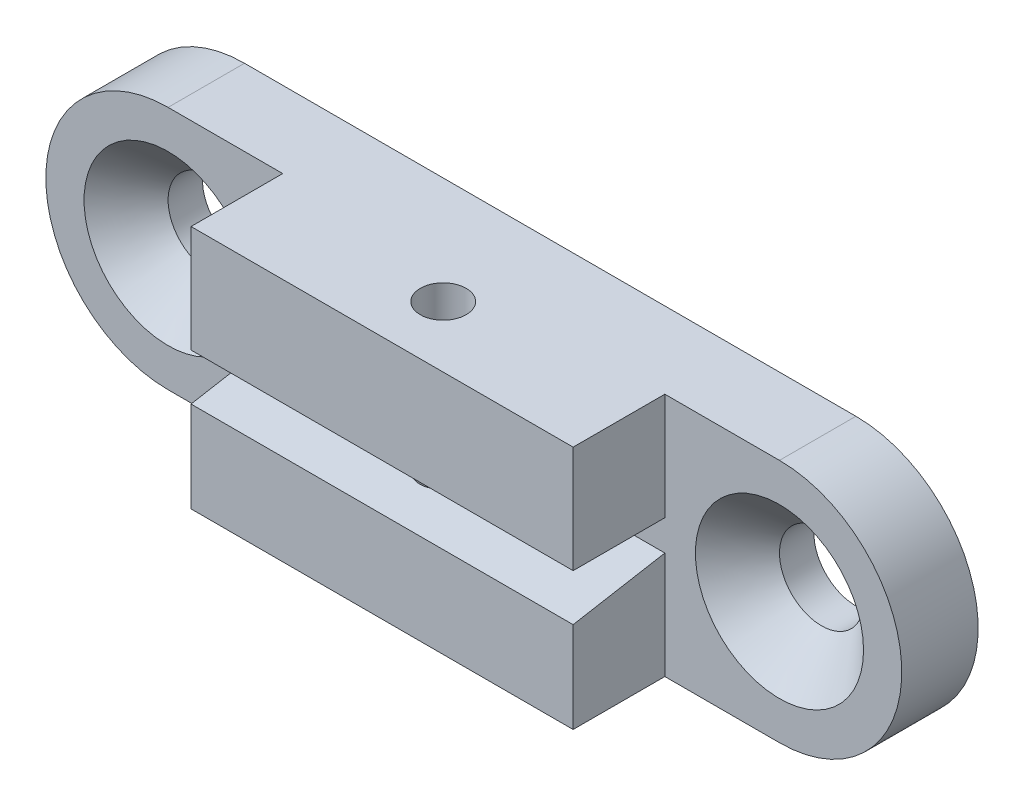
ISO-10303-21;
HEADER;
FILE_DESCRIPTION(('STEP AP214'),'2;1');
FILE_NAME('part.step','',(''),(''),'','','');
FILE_SCHEMA(('AUTOMOTIVE_DESIGN { 1 0 10303 214 1 1 1 1 }'));
ENDSEC;
DATA;
#1=APPLICATION_CONTEXT('core data for automotive mechanical design processes');
#2=APPLICATION_PROTOCOL_DEFINITION('international standard','automotive_design',2000,#1);
#3=PRODUCT_CONTEXT('',#1,'mechanical');
#4=PRODUCT('Part','Part','',(#3));
#5=PRODUCT_RELATED_PRODUCT_CATEGORY('part','',(#4));
#6=PRODUCT_DEFINITION_FORMATION('','',#4);
#7=PRODUCT_DEFINITION_CONTEXT('part definition',#1,'design');
#8=PRODUCT_DEFINITION('design','',#6,#7);
#9=PRODUCT_DEFINITION_SHAPE('','',#8);
#10=(LENGTH_UNIT() NAMED_UNIT(*) SI_UNIT(.MILLI.,.METRE.));
#11=(NAMED_UNIT(*) PLANE_ANGLE_UNIT() SI_UNIT($,.RADIAN.));
#12=(NAMED_UNIT(*) SI_UNIT($,.STERADIAN.) SOLID_ANGLE_UNIT());
#13=UNCERTAINTY_MEASURE_WITH_UNIT(LENGTH_MEASURE(1.E-05),#10,'distance_accuracy_value','');
#14=(GEOMETRIC_REPRESENTATION_CONTEXT(3) GLOBAL_UNCERTAINTY_ASSIGNED_CONTEXT((#13)) GLOBAL_UNIT_ASSIGNED_CONTEXT((#10,
#11,#12)) REPRESENTATION_CONTEXT('',''));
#15=CARTESIAN_POINT('',(0.,0.,0.));
#16=DIRECTION('',(0.,0.,1.));
#17=DIRECTION('',(1.,0.,0.));
#18=AXIS2_PLACEMENT_3D('',#15,#16,#17);
#19=CARTESIAN_POINT('',(12.5,-2.05796188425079,11.));
#20=DIRECTION('',(0.,-0.984807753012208,-0.17364817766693));
#21=DIRECTION('',(0.,0.17364817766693,-0.984807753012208));
#22=AXIS2_PLACEMENT_3D('',#19,#20,#21);
#23=PLANE('',#22);
#24=CARTESIAN_POINT('',(0.,-1.35265396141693,7.));
#25=DIRECTION('',(0.,-0.984807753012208,-0.17364817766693));
#26=DIRECTION('',(0.,0.17364817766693,-0.984807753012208));
#27=AXIS2_PLACEMENT_3D('',#24,#25,#26);
#28=ELLIPSE('',#27,1.52313991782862,1.5);
#29=CARTESIAN_POINT('',(0.,-1.08816349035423,5.5));
#30=VERTEX_POINT('',#29);
#31=EDGE_CURVE('E18',#30,#30,#28,.T.);
#32=ORIENTED_EDGE('',*,*,#31,.T.);
#33=EDGE_LOOP('',(#32));
#34=FACE_BOUND('',#33,.T.);
#35=DIRECTION('',(1.,0.,0.));
#36=VECTOR('',#35,1.);
#37=CARTESIAN_POINT('',(0.,-2.05796188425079,11.));
#38=LINE('',#37,#36);
#39=CARTESIAN_POINT('',(12.5,-2.05796188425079,11.));
#40=VERTEX_POINT('',#39);
#41=CARTESIAN_POINT('',(-12.5,-2.05796188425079,11.));
#42=VERTEX_POINT('',#41);
#43=EDGE_CURVE('E118',#40,#42,#38,.F.);
#44=ORIENTED_EDGE('',*,*,#43,.F.);
#45=DIRECTION('',(0.,-0.17364817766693,0.984807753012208));
#46=VECTOR('',#45,1.);
#47=CARTESIAN_POINT('',(12.5,-1.,5.));
#48=LINE('',#47,#46);
#49=CARTESIAN_POINT('',(12.5,-1.,5.));
#50=VERTEX_POINT('',#49);
#51=EDGE_CURVE('E108',#50,#40,#48,.T.);
#52=ORIENTED_EDGE('',*,*,#51,.F.);
#53=DIRECTION('',(1.,0.,0.));
#54=VECTOR('',#53,1.);
#55=CARTESIAN_POINT('',(0.,-1.,5.));
#56=LINE('',#55,#54);
#57=CARTESIAN_POINT('',(-12.5,-1.,5.));
#58=VERTEX_POINT('',#57);
#59=EDGE_CURVE('E194',#58,#50,#56,.T.);
#60=ORIENTED_EDGE('',*,*,#59,.F.);
#61=DIRECTION('',(0.,0.17364817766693,-0.984807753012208));
#62=VECTOR('',#61,1.);
#63=CARTESIAN_POINT('',(-12.5,-2.05796188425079,11.));
#64=LINE('',#63,#62);
#65=EDGE_CURVE('E125',#42,#58,#64,.T.);
#66=ORIENTED_EDGE('',*,*,#65,.F.);
#67=EDGE_LOOP('',(#44,#52,#60,#66));
#68=FACE_BOUND('',#67,.T.);
#69=ADVANCED_FACE('F15',(#34,#68),#23,.F.);
#70=CARTESIAN_POINT('',(12.5,1.,5.));
#71=DIRECTION('',(0.,1.,0.));
#72=DIRECTION('',(0.,0.,1.));
#73=AXIS2_PLACEMENT_3D('',#70,#71,#72);
#74=PLANE('',#73);
#75=CARTESIAN_POINT('',(0.,1.,7.));
#76=DIRECTION('',(0.,1.,0.));
#77=DIRECTION('',(0.,0.,1.));
#78=AXIS2_PLACEMENT_3D('',#75,#76,#77);
#79=CIRCLE('',#78,1.5);
#80=CARTESIAN_POINT('',(0.,1.,8.5));
#81=VERTEX_POINT('',#80);
#82=EDGE_CURVE('E163',#81,#81,#79,.T.);
#83=ORIENTED_EDGE('',*,*,#82,.T.);
#84=EDGE_LOOP('',(#83));
#85=FACE_BOUND('',#84,.T.);
#86=DIRECTION('',(1.,0.,0.));
#87=VECTOR('',#86,1.);
#88=CARTESIAN_POINT('',(0.,1.,5.));
#89=LINE('',#88,#87);
#90=CARTESIAN_POINT('',(12.5,0.999999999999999,5.));
#91=VERTEX_POINT('',#90);
#92=CARTESIAN_POINT('',(-12.5,1.,5.));
#93=VERTEX_POINT('',#92);
#94=EDGE_CURVE('E162',#91,#93,#89,.F.);
#95=ORIENTED_EDGE('',*,*,#94,.F.);
#96=DIRECTION('',(0.,0.,-1.));
#97=VECTOR('',#96,1.);
#98=CARTESIAN_POINT('',(12.5,0.999999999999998,5.));
#99=LINE('',#98,#97);
#100=CARTESIAN_POINT('',(12.5,0.999999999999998,11.));
#101=VERTEX_POINT('',#100);
#102=EDGE_CURVE('E172',#101,#91,#99,.T.);
#103=ORIENTED_EDGE('',*,*,#102,.F.);
#104=DIRECTION('',(1.,0.,0.));
#105=VECTOR('',#104,1.);
#106=CARTESIAN_POINT('',(0.,0.999999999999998,11.));
#107=LINE('',#106,#105);
#108=CARTESIAN_POINT('',(-12.5,0.999999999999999,11.));
#109=VERTEX_POINT('',#108);
#110=EDGE_CURVE('E130',#109,#101,#107,.T.);
#111=ORIENTED_EDGE('',*,*,#110,.F.);
#112=DIRECTION('',(0.,0.,1.));
#113=VECTOR('',#112,1.);
#114=CARTESIAN_POINT('',(-12.5,1.,5.));
#115=LINE('',#114,#113);
#116=EDGE_CURVE('E207',#93,#109,#115,.T.);
#117=ORIENTED_EDGE('',*,*,#116,.F.);
#118=EDGE_LOOP('',(#95,#103,#111,#117));
#119=FACE_BOUND('',#118,.T.);
#120=ADVANCED_FACE('F261',(#85,#119),#74,.F.);
#121=CARTESIAN_POINT('',(12.5,8.,5.));
#122=DIRECTION('',(1.,0.,0.));
#123=DIRECTION('',(0.,0.,-1.));
#124=AXIS2_PLACEMENT_3D('',#121,#122,#123);
#125=PLANE('',#124);
#126=DIRECTION('',(0.,0.,-1.));
#127=VECTOR('',#126,1.);
#128=CARTESIAN_POINT('',(12.5,-8.,0.));
#129=LINE('',#128,#127);
#130=CARTESIAN_POINT('',(12.5,-8.,5.));
#131=VERTEX_POINT('',#130);
#132=CARTESIAN_POINT('',(12.5,-8.,11.));
#133=VERTEX_POINT('',#132);
#134=EDGE_CURVE('E191',#131,#133,#129,.F.);
#135=ORIENTED_EDGE('',*,*,#134,.F.);
#136=DIRECTION('',(0.,1.,0.));
#137=VECTOR('',#136,1.);
#138=CARTESIAN_POINT('',(12.5,0.,5.));
#139=LINE('',#138,#137);
#140=EDGE_CURVE('E114',#50,#131,#139,.F.);
#141=ORIENTED_EDGE('',*,*,#140,.F.);
#142=ORIENTED_EDGE('',*,*,#51,.T.);
#143=DIRECTION('',(0.,1.,0.));
#144=VECTOR('',#143,1.);
#145=CARTESIAN_POINT('',(12.5,0.,11.));
#146=LINE('',#145,#144);
#147=EDGE_CURVE('E112',#133,#40,#146,.T.);
#148=ORIENTED_EDGE('',*,*,#147,.F.);
#149=EDGE_LOOP('',(#135,#141,#142,#148));
#150=FACE_BOUND('',#149,.T.);
#151=ADVANCED_FACE('F111',(#150),#125,.T.);
#152=CARTESIAN_POINT('',(0.,0.,11.));
#153=DIRECTION('',(0.,0.,1.));
#154=DIRECTION('',(1.,0.,0.));
#155=AXIS2_PLACEMENT_3D('',#152,#153,#154);
#156=PLANE('',#155);
#157=DIRECTION('',(1.,0.,0.));
#158=VECTOR('',#157,1.);
#159=CARTESIAN_POINT('',(20.,-8.,11.));
#160=LINE('',#159,#158);
#161=CARTESIAN_POINT('',(-12.5,-8.,11.));
#162=VERTEX_POINT('',#161);
#163=EDGE_CURVE('E124',#133,#162,#160,.F.);
#164=ORIENTED_EDGE('',*,*,#163,.F.);
#165=ORIENTED_EDGE('',*,*,#147,.T.);
#166=ORIENTED_EDGE('',*,*,#43,.T.);
#167=DIRECTION('',(0.,1.,0.));
#168=VECTOR('',#167,1.);
#169=CARTESIAN_POINT('',(-12.5,-8.,11.));
#170=LINE('',#169,#168);
#171=EDGE_CURVE('E197',#162,#42,#170,.T.);
#172=ORIENTED_EDGE('',*,*,#171,.F.);
#173=EDGE_LOOP('',(#164,#165,#166,#172));
#174=FACE_BOUND('',#173,.T.);
#175=ADVANCED_FACE('F121',(#174),#156,.T.);
#176=CARTESIAN_POINT('',(-12.5,-8.,5.));
#177=DIRECTION('',(-1.,0.,0.));
#178=DIRECTION('',(0.,0.,1.));
#179=AXIS2_PLACEMENT_3D('',#176,#177,#178);
#180=PLANE('',#179);
#181=DIRECTION('',(0.,0.,-1.));
#182=VECTOR('',#181,1.);
#183=CARTESIAN_POINT('',(-12.5,-8.,0.));
#184=LINE('',#183,#182);
#185=CARTESIAN_POINT('',(-12.5,-8.,5.));
#186=VERTEX_POINT('',#185);
#187=EDGE_CURVE('E195',#162,#186,#184,.T.);
#188=ORIENTED_EDGE('',*,*,#187,.F.);
#189=ORIENTED_EDGE('',*,*,#171,.T.);
#190=ORIENTED_EDGE('',*,*,#65,.T.);
#191=DIRECTION('',(0.,1.,0.));
#192=VECTOR('',#191,1.);
#193=CARTESIAN_POINT('',(-12.5,0.,5.));
#194=LINE('',#193,#192);
#195=EDGE_CURVE('E169',#186,#58,#194,.T.);
#196=ORIENTED_EDGE('',*,*,#195,.F.);
#197=EDGE_LOOP('',(#188,#189,#190,#196));
#198=FACE_BOUND('',#197,.T.);
#199=ADVANCED_FACE('F219',(#198),#180,.T.);
#200=CARTESIAN_POINT('',(0.,-8.,7.));
#201=DIRECTION('',(0.,1.,0.));
#202=DIRECTION('',(0.,0.,1.));
#203=AXIS2_PLACEMENT_3D('',#200,#201,#202);
#204=CYLINDRICAL_SURFACE('',#203,1.5);
#205=ORIENTED_EDGE('',*,*,#31,.F.);
#206=EDGE_LOOP('',(#205));
#207=FACE_BOUND('',#206,.T.);
#208=CARTESIAN_POINT('',(0.,-8.,7.));
#209=DIRECTION('',(0.,1.,0.));
#210=DIRECTION('',(0.,0.,1.));
#211=AXIS2_PLACEMENT_3D('',#208,#209,#210);
#212=CIRCLE('',#211,1.5);
#213=CARTESIAN_POINT('',(0.,-8.,8.5));
#214=VERTEX_POINT('',#213);
#215=EDGE_CURVE('E152',#214,#214,#212,.T.);
#216=ORIENTED_EDGE('',*,*,#215,.F.);
#217=EDGE_LOOP('',(#216));
#218=FACE_BOUND('',#217,.T.);
#219=ADVANCED_FACE('F215',(#207,#218),#204,.F.);
#220=CARTESIAN_POINT('',(-12.5,-8.,5.));
#221=DIRECTION('',(-1.,0.,0.));
#222=DIRECTION('',(0.,0.,1.));
#223=AXIS2_PLACEMENT_3D('',#220,#221,#222);
#224=PLANE('',#223);
#225=DIRECTION('',(0.,0.,1.));
#226=VECTOR('',#225,1.);
#227=CARTESIAN_POINT('',(-12.5,8.,0.));
#228=LINE('',#227,#226);
#229=CARTESIAN_POINT('',(-12.5,8.,5.));
#230=VERTEX_POINT('',#229);
#231=CARTESIAN_POINT('',(-12.5,8.,11.));
#232=VERTEX_POINT('',#231);
#233=EDGE_CURVE('E184',#230,#232,#228,.T.);
#234=ORIENTED_EDGE('',*,*,#233,.F.);
#235=DIRECTION('',(0.,1.,0.));
#236=VECTOR('',#235,1.);
#237=CARTESIAN_POINT('',(-12.5,0.,5.));
#238=LINE('',#237,#236);
#239=EDGE_CURVE('E165',#93,#230,#238,.T.);
#240=ORIENTED_EDGE('',*,*,#239,.F.);
#241=ORIENTED_EDGE('',*,*,#116,.T.);
#242=DIRECTION('',(0.,1.,0.));
#243=VECTOR('',#242,1.);
#244=CARTESIAN_POINT('',(-12.5,0.,11.));
#245=LINE('',#244,#243);
#246=EDGE_CURVE('E177',#232,#109,#245,.F.);
#247=ORIENTED_EDGE('',*,*,#246,.F.);
#248=EDGE_LOOP('',(#234,#240,#241,#247));
#249=FACE_BOUND('',#248,.T.);
#250=ADVANCED_FACE('F218',(#249),#224,.T.);
#251=CARTESIAN_POINT('',(0.,0.,11.));
#252=DIRECTION('',(0.,0.,1.));
#253=DIRECTION('',(1.,0.,0.));
#254=AXIS2_PLACEMENT_3D('',#251,#252,#253);
#255=PLANE('',#254);
#256=DIRECTION('',(1.,0.,0.));
#257=VECTOR('',#256,1.);
#258=CARTESIAN_POINT('',(-20.,8.,11.));
#259=LINE('',#258,#257);
#260=CARTESIAN_POINT('',(12.5,8.,11.));
#261=VERTEX_POINT('',#260);
#262=EDGE_CURVE('E182',#232,#261,#259,.T.);
#263=ORIENTED_EDGE('',*,*,#262,.F.);
#264=ORIENTED_EDGE('',*,*,#246,.T.);
#265=ORIENTED_EDGE('',*,*,#110,.T.);
#266=DIRECTION('',(0.,1.,0.));
#267=VECTOR('',#266,1.);
#268=CARTESIAN_POINT('',(12.5,8.,11.));
#269=LINE('',#268,#267);
#270=EDGE_CURVE('E166',#261,#101,#269,.F.);
#271=ORIENTED_EDGE('',*,*,#270,.F.);
#272=EDGE_LOOP('',(#263,#264,#265,#271));
#273=FACE_BOUND('',#272,.T.);
#274=ADVANCED_FACE('F265',(#273),#255,.T.);
#275=CARTESIAN_POINT('',(12.5,8.,5.));
#276=DIRECTION('',(1.,0.,0.));
#277=DIRECTION('',(0.,0.,-1.));
#278=AXIS2_PLACEMENT_3D('',#275,#276,#277);
#279=PLANE('',#278);
#280=DIRECTION('',(0.,0.,1.));
#281=VECTOR('',#280,1.);
#282=CARTESIAN_POINT('',(12.5,8.,0.));
#283=LINE('',#282,#281);
#284=CARTESIAN_POINT('',(12.5,8.,5.));
#285=VERTEX_POINT('',#284);
#286=EDGE_CURVE('E63',#261,#285,#283,.F.);
#287=ORIENTED_EDGE('',*,*,#286,.F.);
#288=ORIENTED_EDGE('',*,*,#270,.T.);
#289=ORIENTED_EDGE('',*,*,#102,.T.);
#290=DIRECTION('',(0.,1.,0.));
#291=VECTOR('',#290,1.);
#292=CARTESIAN_POINT('',(12.5,0.,5.));
#293=LINE('',#292,#291);
#294=EDGE_CURVE('E201',#285,#91,#293,.F.);
#295=ORIENTED_EDGE('',*,*,#294,.F.);
#296=EDGE_LOOP('',(#287,#288,#289,#295));
#297=FACE_BOUND('',#296,.T.);
#298=ADVANCED_FACE('F324',(#297),#279,.T.);
#299=CARTESIAN_POINT('',(0.,-8.,7.));
#300=DIRECTION('',(0.,1.,0.));
#301=DIRECTION('',(0.,0.,1.));
#302=AXIS2_PLACEMENT_3D('',#299,#300,#301);
#303=CYLINDRICAL_SURFACE('',#302,1.5);
#304=CARTESIAN_POINT('',(0.,8.,7.));
#305=DIRECTION('',(0.,1.,0.));
#306=DIRECTION('',(0.,0.,1.));
#307=AXIS2_PLACEMENT_3D('',#304,#305,#306);
#308=CIRCLE('',#307,1.5);
#309=CARTESIAN_POINT('',(0.,8.,8.5));
#310=VERTEX_POINT('',#309);
#311=EDGE_CURVE('E144',#310,#310,#308,.F.);
#312=ORIENTED_EDGE('',*,*,#311,.F.);
#313=EDGE_LOOP('',(#312));
#314=FACE_BOUND('',#313,.T.);
#315=ORIENTED_EDGE('',*,*,#82,.F.);
#316=EDGE_LOOP('',(#315));
#317=FACE_BOUND('',#316,.T.);
#318=ADVANCED_FACE('F320',(#314,#317),#303,.F.);
#319=CARTESIAN_POINT('',(0.,0.,5.));
#320=DIRECTION('',(0.,0.,1.));
#321=DIRECTION('',(1.,0.,0.));
#322=AXIS2_PLACEMENT_3D('',#319,#320,#321);
#323=PLANE('',#322);
#324=CARTESIAN_POINT('',(-20.,0.,5.00000000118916));
#325=DIRECTION('',(0.,0.,1.));
#326=DIRECTION('',(1.,0.,0.));
#327=AXIS2_PLACEMENT_3D('',#324,#325,#326);
#328=CIRCLE('',#327,5.49999999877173);
#329=CARTESIAN_POINT('',(-14.5000000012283,0.,5.00000000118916));
#330=VERTEX_POINT('',#329);
#331=EDGE_CURVE('E156',#330,#330,#328,.F.);
#332=ORIENTED_EDGE('',*,*,#331,.T.);
#333=EDGE_LOOP('',(#332));
#334=FACE_BOUND('',#333,.T.);
#335=CARTESIAN_POINT('',(20.,0.,5.00000000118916));
#336=DIRECTION('',(0.,0.,1.));
#337=DIRECTION('',(1.,0.,0.));
#338=AXIS2_PLACEMENT_3D('',#335,#336,#337);
#339=CIRCLE('',#338,5.49999999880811);
#340=CARTESIAN_POINT('',(25.4999999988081,0.,5.00000000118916));
#341=VERTEX_POINT('',#340);
#342=EDGE_CURVE('E160',#341,#341,#339,.F.);
#343=ORIENTED_EDGE('',*,*,#342,.T.);
#344=EDGE_LOOP('',(#343));
#345=FACE_BOUND('',#344,.T.);
#346=ORIENTED_EDGE('',*,*,#294,.T.);
#347=ORIENTED_EDGE('',*,*,#94,.T.);
#348=ORIENTED_EDGE('',*,*,#239,.T.);
#349=DIRECTION('',(1.,0.,0.));
#350=VECTOR('',#349,1.);
#351=CARTESIAN_POINT('',(-20.,8.,5.));
#352=LINE('',#351,#350);
#353=CARTESIAN_POINT('',(-20.,8.,5.));
#354=VERTEX_POINT('',#353);
#355=EDGE_CURVE('E187',#354,#230,#352,.T.);
#356=ORIENTED_EDGE('',*,*,#355,.F.);
#357=CARTESIAN_POINT('',(-20.,0.,5.));
#358=DIRECTION('',(0.,0.,1.));
#359=DIRECTION('',(1.,0.,0.));
#360=AXIS2_PLACEMENT_3D('',#357,#358,#359);
#361=CIRCLE('',#360,8.);
#362=CARTESIAN_POINT('',(-20.,-8.,5.));
#363=VERTEX_POINT('',#362);
#364=EDGE_CURVE('E142',#363,#354,#361,.F.);
#365=ORIENTED_EDGE('',*,*,#364,.F.);
#366=DIRECTION('',(1.,0.,0.));
#367=VECTOR('',#366,1.);
#368=CARTESIAN_POINT('',(20.,-8.,5.));
#369=LINE('',#368,#367);
#370=EDGE_CURVE('E155',#186,#363,#369,.F.);
#371=ORIENTED_EDGE('',*,*,#370,.F.);
#372=ORIENTED_EDGE('',*,*,#195,.T.);
#373=ORIENTED_EDGE('',*,*,#59,.T.);
#374=ORIENTED_EDGE('',*,*,#140,.T.);
#375=DIRECTION('',(1.,0.,0.));
#376=VECTOR('',#375,1.);
#377=CARTESIAN_POINT('',(20.,-8.,5.));
#378=LINE('',#377,#376);
#379=CARTESIAN_POINT('',(20.,-8.,5.));
#380=VERTEX_POINT('',#379);
#381=EDGE_CURVE('E159',#380,#131,#378,.F.);
#382=ORIENTED_EDGE('',*,*,#381,.F.);
#383=CARTESIAN_POINT('',(20.,0.,5.));
#384=DIRECTION('',(0.,0.,1.));
#385=DIRECTION('',(1.,0.,0.));
#386=AXIS2_PLACEMENT_3D('',#383,#384,#385);
#387=CIRCLE('',#386,8.);
#388=CARTESIAN_POINT('',(20.,8.,5.));
#389=VERTEX_POINT('',#388);
#390=EDGE_CURVE('E148',#389,#380,#387,.F.);
#391=ORIENTED_EDGE('',*,*,#390,.F.);
#392=DIRECTION('',(1.,0.,0.));
#393=VECTOR('',#392,1.);
#394=CARTESIAN_POINT('',(-20.,8.,5.));
#395=LINE('',#394,#393);
#396=EDGE_CURVE('E57',#285,#389,#395,.T.);
#397=ORIENTED_EDGE('',*,*,#396,.F.);
#398=EDGE_LOOP('',(#346,#347,#348,#356,#365,#371,#372,#373,#374,#382,#391,#397));
#399=FACE_BOUND('',#398,.T.);
#400=ADVANCED_FACE('F259',(#334,#345,#399),#323,.T.);
#401=CARTESIAN_POINT('',(20.,0.,5.00000000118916));
#402=DIRECTION('',(0.,0.,1.));
#403=DIRECTION('',(1.,0.,0.));
#404=AXIS2_PLACEMENT_3D('',#401,#402,#403);
#405=CONICAL_SURFACE('',#404,5.49999999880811,0.785398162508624);
#406=ORIENTED_EDGE('',*,*,#342,.F.);
#407=EDGE_LOOP('',(#406));
#408=FACE_BOUND('',#407,.T.);
#409=CARTESIAN_POINT('',(20.,0.,2.25));
#410=DIRECTION('',(0.,0.,1.));
#411=DIRECTION('',(1.,0.,0.));
#412=AXIS2_PLACEMENT_3D('',#409,#410,#411);
#413=CIRCLE('',#412,2.75);
#414=CARTESIAN_POINT('',(22.75,0.,2.25));
#415=VERTEX_POINT('',#414);
#416=EDGE_CURVE('E239',#415,#415,#413,.F.);
#417=ORIENTED_EDGE('',*,*,#416,.T.);
#418=EDGE_LOOP('',(#417));
#419=FACE_BOUND('',#418,.T.);
#420=ADVANCED_FACE('F313',(#408,#419),#405,.F.);
#421=CARTESIAN_POINT('',(-20.,0.,5.00000000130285));
#422=DIRECTION('',(0.,0.,1.));
#423=DIRECTION('',(1.,0.,0.));
#424=AXIS2_PLACEMENT_3D('',#421,#422,#423);
#425=CONICAL_SURFACE('',#424,5.49999999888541,0.785398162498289);
#426=ORIENTED_EDGE('',*,*,#331,.F.);
#427=EDGE_LOOP('',(#426));
#428=FACE_BOUND('',#427,.T.);
#429=CARTESIAN_POINT('',(-20.,0.,2.25));
#430=DIRECTION('',(0.,0.,1.));
#431=DIRECTION('',(1.,0.,0.));
#432=AXIS2_PLACEMENT_3D('',#429,#430,#431);
#433=CIRCLE('',#432,2.75);
#434=CARTESIAN_POINT('',(-17.25,0.,2.25));
#435=VERTEX_POINT('',#434);
#436=EDGE_CURVE('E236',#435,#435,#433,.F.);
#437=ORIENTED_EDGE('',*,*,#436,.T.);
#438=EDGE_LOOP('',(#437));
#439=FACE_BOUND('',#438,.T.);
#440=ADVANCED_FACE('F227',(#428,#439),#425,.F.);
#441=CARTESIAN_POINT('',(20.,-8.,0.));
#442=DIRECTION('',(0.,-1.,0.));
#443=DIRECTION('',(0.,0.,-1.));
#444=AXIS2_PLACEMENT_3D('',#441,#442,#443);
#445=PLANE('',#444);
#446=ORIENTED_EDGE('',*,*,#215,.T.);
#447=EDGE_LOOP('',(#446));
#448=FACE_BOUND('',#447,.T.);
#449=DIRECTION('',(1.,0.,0.));
#450=VECTOR('',#449,1.);
#451=CARTESIAN_POINT('',(0.,-8.,0.));
#452=LINE('',#451,#450);
#453=CARTESIAN_POINT('',(-20.,-8.,0.));
#454=VERTEX_POINT('',#453);
#455=CARTESIAN_POINT('',(20.,-8.,0.));
#456=VERTEX_POINT('',#455);
#457=EDGE_CURVE('E141',#454,#456,#452,.T.);
#458=ORIENTED_EDGE('',*,*,#457,.T.);
#459=DIRECTION('',(0.,0.,1.));
#460=VECTOR('',#459,1.);
#461=CARTESIAN_POINT('',(20.,-8.,0.));
#462=LINE('',#461,#460);
#463=EDGE_CURVE('E151',#380,#456,#462,.F.);
#464=ORIENTED_EDGE('',*,*,#463,.F.);
#465=ORIENTED_EDGE('',*,*,#381,.T.);
#466=ORIENTED_EDGE('',*,*,#134,.T.);
#467=ORIENTED_EDGE('',*,*,#163,.T.);
#468=ORIENTED_EDGE('',*,*,#187,.T.);
#469=ORIENTED_EDGE('',*,*,#370,.T.);
#470=DIRECTION('',(0.,0.,1.));
#471=VECTOR('',#470,1.);
#472=CARTESIAN_POINT('',(-20.,-8.,0.));
#473=LINE('',#472,#471);
#474=EDGE_CURVE('E233',#454,#363,#473,.T.);
#475=ORIENTED_EDGE('',*,*,#474,.F.);
#476=EDGE_LOOP('',(#458,#464,#465,#466,#467,#468,#469,#475));
#477=FACE_BOUND('',#476,.T.);
#478=ADVANCED_FACE('F223',(#448,#477),#445,.T.);
#479=CARTESIAN_POINT('',(20.,0.,0.));
#480=DIRECTION('',(0.,0.,1.));
#481=DIRECTION('',(1.,0.,0.));
#482=AXIS2_PLACEMENT_3D('',#479,#480,#481);
#483=CYLINDRICAL_SURFACE('',#482,8.);
#484=CARTESIAN_POINT('',(20.,0.,0.));
#485=DIRECTION('',(0.,0.,1.));
#486=DIRECTION('',(1.,0.,0.));
#487=AXIS2_PLACEMENT_3D('',#484,#485,#486);
#488=CIRCLE('',#487,8.);
#489=CARTESIAN_POINT('',(20.,8.,0.));
#490=VERTEX_POINT('',#489);
#491=EDGE_CURVE('E138',#456,#490,#488,.T.);
#492=ORIENTED_EDGE('',*,*,#491,.T.);
#493=DIRECTION('',(0.,0.,1.));
#494=VECTOR('',#493,1.);
#495=CARTESIAN_POINT('',(20.,8.,0.));
#496=LINE('',#495,#494);
#497=EDGE_CURVE('E147',#389,#490,#496,.F.);
#498=ORIENTED_EDGE('',*,*,#497,.F.);
#499=ORIENTED_EDGE('',*,*,#390,.T.);
#500=ORIENTED_EDGE('',*,*,#463,.T.);
#501=EDGE_LOOP('',(#492,#498,#499,#500));
#502=FACE_BOUND('',#501,.T.);
#503=ADVANCED_FACE('F226',(#502),#483,.T.);
#504=CARTESIAN_POINT('',(-20.,8.,0.));
#505=DIRECTION('',(0.,1.,0.));
#506=DIRECTION('',(0.,0.,1.));
#507=AXIS2_PLACEMENT_3D('',#504,#505,#506);
#508=PLANE('',#507);
#509=ORIENTED_EDGE('',*,*,#311,.T.);
#510=EDGE_LOOP('',(#509));
#511=FACE_BOUND('',#510,.T.);
#512=DIRECTION('',(1.,0.,0.));
#513=VECTOR('',#512,1.);
#514=CARTESIAN_POINT('',(0.,8.,0.));
#515=LINE('',#514,#513);
#516=CARTESIAN_POINT('',(-20.,8.,0.));
#517=VERTEX_POINT('',#516);
#518=EDGE_CURVE('E137',#490,#517,#515,.F.);
#519=ORIENTED_EDGE('',*,*,#518,.T.);
#520=DIRECTION('',(0.,0.,1.));
#521=VECTOR('',#520,1.);
#522=CARTESIAN_POINT('',(-20.,8.,0.));
#523=LINE('',#522,#521);
#524=EDGE_CURVE('E33',#354,#517,#523,.F.);
#525=ORIENTED_EDGE('',*,*,#524,.F.);
#526=ORIENTED_EDGE('',*,*,#355,.T.);
#527=ORIENTED_EDGE('',*,*,#233,.T.);
#528=ORIENTED_EDGE('',*,*,#262,.T.);
#529=ORIENTED_EDGE('',*,*,#286,.T.);
#530=ORIENTED_EDGE('',*,*,#396,.T.);
#531=ORIENTED_EDGE('',*,*,#497,.T.);
#532=EDGE_LOOP('',(#519,#525,#526,#527,#528,#529,#530,#531));
#533=FACE_BOUND('',#532,.T.);
#534=ADVANCED_FACE('F268',(#511,#533),#508,.T.);
#535=CARTESIAN_POINT('',(-20.,0.,0.));
#536=DIRECTION('',(0.,0.,1.));
#537=DIRECTION('',(1.,0.,0.));
#538=AXIS2_PLACEMENT_3D('',#535,#536,#537);
#539=CYLINDRICAL_SURFACE('',#538,8.);
#540=CARTESIAN_POINT('',(-20.,0.,0.));
#541=DIRECTION('',(0.,0.,1.));
#542=DIRECTION('',(1.,0.,0.));
#543=AXIS2_PLACEMENT_3D('',#540,#541,#542);
#544=CIRCLE('',#543,8.);
#545=EDGE_CURVE('E135',#517,#454,#544,.T.);
#546=ORIENTED_EDGE('',*,*,#545,.T.);
#547=ORIENTED_EDGE('',*,*,#474,.T.);
#548=ORIENTED_EDGE('',*,*,#364,.T.);
#549=ORIENTED_EDGE('',*,*,#524,.T.);
#550=EDGE_LOOP('',(#546,#547,#548,#549));
#551=FACE_BOUND('',#550,.T.);
#552=ADVANCED_FACE('F272',(#551),#539,.T.);
#553=CARTESIAN_POINT('',(20.,0.,0.));
#554=DIRECTION('',(0.,0.,1.));
#555=DIRECTION('',(1.,0.,0.));
#556=AXIS2_PLACEMENT_3D('',#553,#554,#555);
#557=CYLINDRICAL_SURFACE('',#556,2.75);
#558=ORIENTED_EDGE('',*,*,#416,.F.);
#559=EDGE_LOOP('',(#558));
#560=FACE_BOUND('',#559,.T.);
#561=CARTESIAN_POINT('',(20.,0.,0.));
#562=DIRECTION('',(0.,0.,1.));
#563=DIRECTION('',(1.,0.,0.));
#564=AXIS2_PLACEMENT_3D('',#561,#562,#563);
#565=CIRCLE('',#564,2.75);
#566=CARTESIAN_POINT('',(22.75,0.,0.));
#567=VERTEX_POINT('',#566);
#568=EDGE_CURVE('E24',#567,#567,#565,.F.);
#569=ORIENTED_EDGE('',*,*,#568,.T.);
#570=EDGE_LOOP('',(#569));
#571=FACE_BOUND('',#570,.T.);
#572=ADVANCED_FACE('F295',(#560,#571),#557,.F.);
#573=CARTESIAN_POINT('',(-20.,0.,0.));
#574=DIRECTION('',(0.,0.,1.));
#575=DIRECTION('',(1.,0.,0.));
#576=AXIS2_PLACEMENT_3D('',#573,#574,#575);
#577=CYLINDRICAL_SURFACE('',#576,2.75);
#578=ORIENTED_EDGE('',*,*,#436,.F.);
#579=EDGE_LOOP('',(#578));
#580=FACE_BOUND('',#579,.T.);
#581=CARTESIAN_POINT('',(-20.,0.,0.));
#582=DIRECTION('',(0.,0.,1.));
#583=DIRECTION('',(1.,0.,0.));
#584=AXIS2_PLACEMENT_3D('',#581,#582,#583);
#585=CIRCLE('',#584,2.75);
#586=CARTESIAN_POINT('',(-17.25,0.,0.));
#587=VERTEX_POINT('',#586);
#588=EDGE_CURVE('E10',#587,#587,#585,.F.);
#589=ORIENTED_EDGE('',*,*,#588,.T.);
#590=EDGE_LOOP('',(#589));
#591=FACE_BOUND('',#590,.T.);
#592=ADVANCED_FACE('F289',(#580,#591),#577,.F.);
#593=CARTESIAN_POINT('',(0.,0.,0.));
#594=DIRECTION('',(0.,0.,1.));
#595=DIRECTION('',(1.,0.,0.));
#596=AXIS2_PLACEMENT_3D('',#593,#594,#595);
#597=PLANE('',#596);
#598=ORIENTED_EDGE('',*,*,#588,.F.);
#599=EDGE_LOOP('',(#598));
#600=FACE_BOUND('',#599,.T.);
#601=ORIENTED_EDGE('',*,*,#568,.F.);
#602=EDGE_LOOP('',(#601));
#603=FACE_BOUND('',#602,.T.);
#604=ORIENTED_EDGE('',*,*,#518,.F.);
#605=ORIENTED_EDGE('',*,*,#491,.F.);
#606=ORIENTED_EDGE('',*,*,#457,.F.);
#607=ORIENTED_EDGE('',*,*,#545,.F.);
#608=EDGE_LOOP('',(#604,#605,#606,#607));
#609=FACE_BOUND('',#608,.T.);
#610=ADVANCED_FACE('F274',(#600,#603,#609),#597,.F.);
#611=CLOSED_SHELL('',(#69,#120,#151,#175,#199,#219,#250,#274,#298,#318,#400,#420,#440,#478,#503,
#534,#552,#572,#592,#610));
#612=MANIFOLD_SOLID_BREP('B1',#611);
#613=ADVANCED_BREP_SHAPE_REPRESENTATION('',(#18,#612),#14);
#614=SHAPE_DEFINITION_REPRESENTATION(#9,#613);
ENDSEC;
END-ISO-10303-21;
